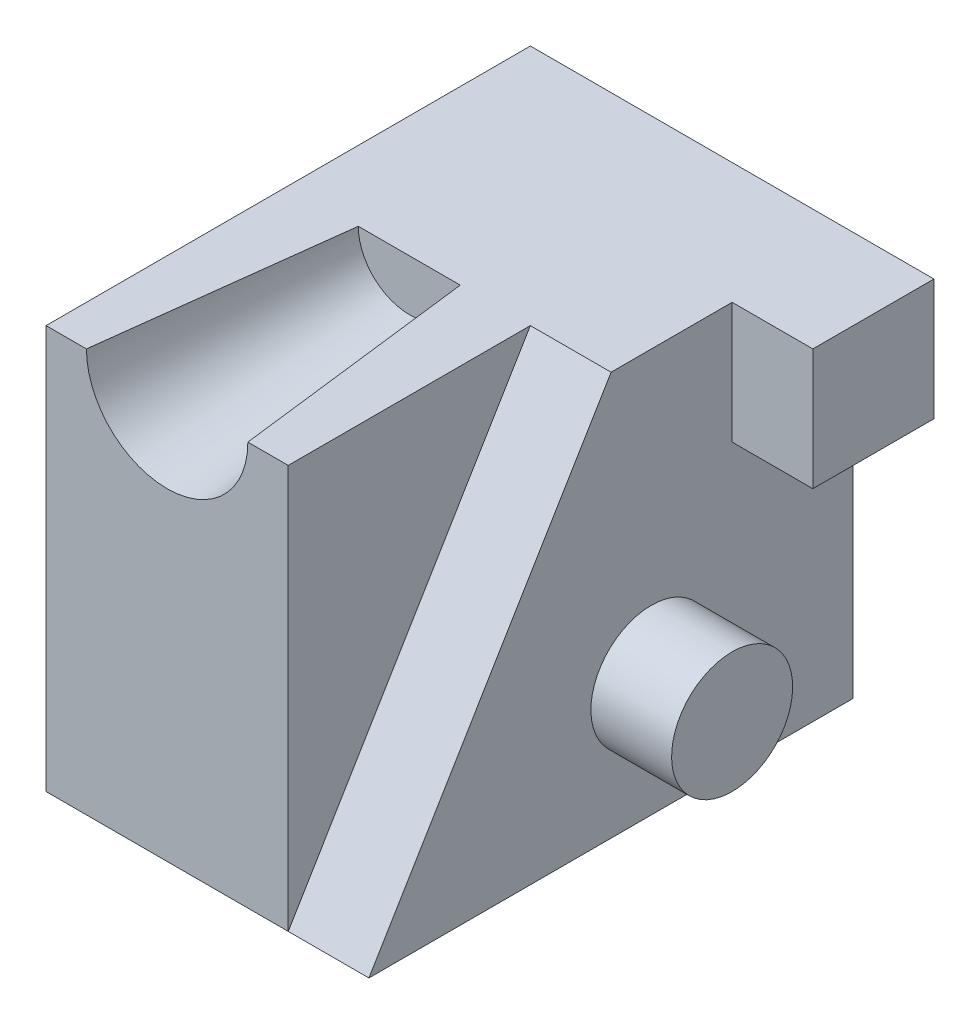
ISO-10303-21;
HEADER;
FILE_DESCRIPTION(('STEP AP214'),'2;1');
FILE_NAME('part.step','',(''),(''),'','','');
FILE_SCHEMA(('AUTOMOTIVE_DESIGN { 1 0 10303 214 1 1 1 1 }'));
ENDSEC;
DATA;
#1=APPLICATION_CONTEXT('core data for automotive mechanical design processes');
#2=APPLICATION_PROTOCOL_DEFINITION('international standard','automotive_design',2000,#1);
#3=PRODUCT_CONTEXT('',#1,'mechanical');
#4=PRODUCT('Part','Part','',(#3));
#5=PRODUCT_RELATED_PRODUCT_CATEGORY('part','',(#4));
#6=PRODUCT_DEFINITION_FORMATION('','',#4);
#7=PRODUCT_DEFINITION_CONTEXT('part definition',#1,'design');
#8=PRODUCT_DEFINITION('design','',#6,#7);
#9=PRODUCT_DEFINITION_SHAPE('','',#8);
#10=(LENGTH_UNIT() NAMED_UNIT(*) SI_UNIT(.MILLI.,.METRE.));
#11=(NAMED_UNIT(*) PLANE_ANGLE_UNIT() SI_UNIT($,.RADIAN.));
#12=(NAMED_UNIT(*) SI_UNIT($,.STERADIAN.) SOLID_ANGLE_UNIT());
#13=UNCERTAINTY_MEASURE_WITH_UNIT(LENGTH_MEASURE(1.E-05),#10,'distance_accuracy_value','');
#14=(GEOMETRIC_REPRESENTATION_CONTEXT(3) GLOBAL_UNCERTAINTY_ASSIGNED_CONTEXT((#13)) GLOBAL_UNIT_ASSIGNED_CONTEXT((#10,
#11,#12)) REPRESENTATION_CONTEXT('',''));
#15=CARTESIAN_POINT('',(0.,0.,0.));
#16=DIRECTION('',(0.,0.,1.));
#17=DIRECTION('',(1.,0.,0.));
#18=AXIS2_PLACEMENT_3D('',#15,#16,#17);
#19=CARTESIAN_POINT('',(0.,0.,30.));
#20=DIRECTION('',(0.,1.,0.));
#21=DIRECTION('',(0.,0.,1.));
#22=AXIS2_PLACEMENT_3D('',#19,#20,#21);
#23=PLANE('',#22);
#24=DIRECTION('',(0.,0.,-1.));
#25=VECTOR('',#24,1.);
#26=CARTESIAN_POINT('',(40.,0.,30.));
#27=LINE('',#26,#25);
#28=CARTESIAN_POINT('',(40.,0.,30.));
#29=VERTEX_POINT('',#28);
#30=CARTESIAN_POINT('',(40.,0.,-30.));
#31=VERTEX_POINT('',#30);
#32=EDGE_CURVE('E212',#29,#31,#27,.T.);
#33=ORIENTED_EDGE('',*,*,#32,.F.);
#34=DIRECTION('',(1.,0.,0.));
#35=VECTOR('',#34,1.);
#36=CARTESIAN_POINT('',(30.,0.,30.));
#37=LINE('',#36,#35);
#38=CARTESIAN_POINT('',(30.,0.,30.));
#39=VERTEX_POINT('',#38);
#40=EDGE_CURVE('E173',#39,#29,#37,.T.);
#41=ORIENTED_EDGE('',*,*,#40,.F.);
#42=DIRECTION('',(1.,0.,0.));
#43=VECTOR('',#42,1.);
#44=CARTESIAN_POINT('',(0.,0.,30.));
#45=LINE('',#44,#43);
#46=CARTESIAN_POINT('',(0.,0.,30.));
#47=VERTEX_POINT('',#46);
#48=EDGE_CURVE('E190',#47,#39,#45,.T.);
#49=ORIENTED_EDGE('',*,*,#48,.F.);
#50=DIRECTION('',(0.,0.,-1.));
#51=VECTOR('',#50,1.);
#52=CARTESIAN_POINT('',(0.,0.,30.));
#53=LINE('',#52,#51);
#54=CARTESIAN_POINT('',(0.,0.,-30.));
#55=VERTEX_POINT('',#54);
#56=EDGE_CURVE('E137',#47,#55,#53,.T.);
#57=ORIENTED_EDGE('',*,*,#56,.T.);
#58=DIRECTION('',(1.,0.,0.));
#59=VECTOR('',#58,1.);
#60=CARTESIAN_POINT('',(0.,0.,-30.));
#61=LINE('',#60,#59);
#62=EDGE_CURVE('E181',#55,#31,#61,.T.);
#63=ORIENTED_EDGE('',*,*,#62,.T.);
#64=EDGE_LOOP('',(#33,#41,#49,#57,#63));
#65=FACE_BOUND('',#64,.T.);
#66=ADVANCED_FACE('F34',(#65),#23,.F.);
#67=CARTESIAN_POINT('',(50.,0.,30.));
#68=DIRECTION('',(-1.,0.,0.));
#69=DIRECTION('',(0.,-1.,0.));
#70=AXIS2_PLACEMENT_3D('',#67,#68,#69);
#71=PLANE('',#70);
#72=DIRECTION('',(0.,0.,-1.));
#73=VECTOR('',#72,1.);
#74=CARTESIAN_POINT('',(50.,35.,-30.));
#75=LINE('',#74,#73);
#76=CARTESIAN_POINT('',(50.,35.,-15.));
#77=VERTEX_POINT('',#76);
#78=CARTESIAN_POINT('',(50.,35.,-30.));
#79=VERTEX_POINT('',#78);
#80=EDGE_CURVE('E124',#77,#79,#75,.T.);
#81=ORIENTED_EDGE('',*,*,#80,.T.);
#82=DIRECTION('',(0.,1.,0.));
#83=VECTOR('',#82,1.);
#84=CARTESIAN_POINT('',(50.,0.,-30.));
#85=LINE('',#84,#83);
#86=CARTESIAN_POINT('',(50.,50.,-30.));
#87=VERTEX_POINT('',#86);
#88=EDGE_CURVE('E135',#79,#87,#85,.T.);
#89=ORIENTED_EDGE('',*,*,#88,.T.);
#90=DIRECTION('',(0.,0.,-1.));
#91=VECTOR('',#90,1.);
#92=CARTESIAN_POINT('',(50.,50.,30.));
#93=LINE('',#92,#91);
#94=CARTESIAN_POINT('',(50.,50.,-15.));
#95=VERTEX_POINT('',#94);
#96=EDGE_CURVE('E128',#95,#87,#93,.T.);
#97=ORIENTED_EDGE('',*,*,#96,.F.);
#98=DIRECTION('',(0.,-1.,0.));
#99=VECTOR('',#98,1.);
#100=CARTESIAN_POINT('',(50.,50.,-15.));
#101=LINE('',#100,#99);
#102=EDGE_CURVE('E114',#95,#77,#101,.T.);
#103=ORIENTED_EDGE('',*,*,#102,.T.);
#104=EDGE_LOOP('',(#81,#89,#97,#103));
#105=FACE_BOUND('',#104,.T.);
#106=ADVANCED_FACE('F133',(#105),#71,.F.);
#107=CARTESIAN_POINT('',(0.,50.,30.));
#108=DIRECTION('',(0.,-1.,0.));
#109=DIRECTION('',(0.,0.,-1.));
#110=AXIS2_PLACEMENT_3D('',#107,#108,#109);
#111=PLANE('',#110);
#112=DIRECTION('',(-1.,0.,0.));
#113=VECTOR('',#112,1.);
#114=CARTESIAN_POINT('',(0.,50.,-30.));
#115=LINE('',#114,#113);
#116=CARTESIAN_POINT('',(0.,50.,-30.));
#117=VERTEX_POINT('',#116);
#118=EDGE_CURVE('E185',#87,#117,#115,.T.);
#119=ORIENTED_EDGE('',*,*,#118,.T.);
#120=DIRECTION('',(0.,0.,-1.));
#121=VECTOR('',#120,1.);
#122=CARTESIAN_POINT('',(0.,50.,30.));
#123=LINE('',#122,#121);
#124=CARTESIAN_POINT('',(0.,50.,30.));
#125=VERTEX_POINT('',#124);
#126=EDGE_CURVE('E138',#125,#117,#123,.T.);
#127=ORIENTED_EDGE('',*,*,#126,.F.);
#128=DIRECTION('',(-1.,0.,0.));
#129=VECTOR('',#128,1.);
#130=CARTESIAN_POINT('',(0.,50.,30.));
#131=LINE('',#130,#129);
#132=CARTESIAN_POINT('',(5.,50.,30.));
#133=VERTEX_POINT('',#132);
#134=EDGE_CURVE('E160',#133,#125,#131,.T.);
#135=ORIENTED_EDGE('',*,*,#134,.F.);
#136=DIRECTION('',(0.121869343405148,0.,-0.992546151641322));
#137=VECTOR('',#136,1.);
#138=CARTESIAN_POINT('',(15.,50.,-51.4434642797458));
#139=LINE('',#138,#137);
#140=CARTESIAN_POINT('',(8.68353682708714,50.,0.));
#141=VERTEX_POINT('',#140);
#142=EDGE_CURVE('E56',#133,#141,#139,.T.);
#143=ORIENTED_EDGE('',*,*,#142,.T.);
#144=DIRECTION('',(-1.,0.,0.));
#145=VECTOR('',#144,1.);
#146=CARTESIAN_POINT('',(0.,50.,0.));
#147=LINE('',#146,#145);
#148=CARTESIAN_POINT('',(21.3164631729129,50.,0.));
#149=VERTEX_POINT('',#148);
#150=EDGE_CURVE('E42',#149,#141,#147,.T.);
#151=ORIENTED_EDGE('',*,*,#150,.F.);
#152=DIRECTION('',(0.121869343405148,0.,0.992546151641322));
#153=VECTOR('',#152,1.);
#154=CARTESIAN_POINT('',(15.,50.,-51.4434642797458));
#155=LINE('',#154,#153);
#156=CARTESIAN_POINT('',(25.,50.,30.));
#157=VERTEX_POINT('',#156);
#158=EDGE_CURVE('E155',#149,#157,#155,.T.);
#159=ORIENTED_EDGE('',*,*,#158,.T.);
#160=CARTESIAN_POINT('',(30.,50.,30.));
#161=VERTEX_POINT('',#160);
#162=EDGE_CURVE('E144',#161,#157,#131,.T.);
#163=ORIENTED_EDGE('',*,*,#162,.F.);
#164=DIRECTION('',(0.,0.,1.));
#165=VECTOR('',#164,1.);
#166=CARTESIAN_POINT('',(30.,50.,30.));
#167=LINE('',#166,#165);
#168=CARTESIAN_POINT('',(30.,50.,0.));
#169=VERTEX_POINT('',#168);
#170=EDGE_CURVE('E171',#169,#161,#167,.T.);
#171=ORIENTED_EDGE('',*,*,#170,.F.);
#172=DIRECTION('',(1.,0.,0.));
#173=VECTOR('',#172,1.);
#174=CARTESIAN_POINT('',(30.,50.,0.));
#175=LINE('',#174,#173);
#176=CARTESIAN_POINT('',(40.,50.,0.));
#177=VERTEX_POINT('',#176);
#178=EDGE_CURVE('E174',#169,#177,#175,.T.);
#179=ORIENTED_EDGE('',*,*,#178,.T.);
#180=DIRECTION('',(0.,0.,1.));
#181=VECTOR('',#180,1.);
#182=CARTESIAN_POINT('',(40.,50.,30.));
#183=LINE('',#182,#181);
#184=CARTESIAN_POINT('',(40.,50.,-15.));
#185=VERTEX_POINT('',#184);
#186=EDGE_CURVE('E48',#185,#177,#183,.T.);
#187=ORIENTED_EDGE('',*,*,#186,.F.);
#188=DIRECTION('',(1.,0.,0.));
#189=VECTOR('',#188,1.);
#190=CARTESIAN_POINT('',(40.,50.,-15.));
#191=LINE('',#190,#189);
#192=EDGE_CURVE('E118',#185,#95,#191,.T.);
#193=ORIENTED_EDGE('',*,*,#192,.T.);
#194=ORIENTED_EDGE('',*,*,#96,.T.);
#195=EDGE_LOOP('',(#119,#127,#135,#143,#151,#159,#163,#171,#179,#187,#193,#194));
#196=FACE_BOUND('',#195,.T.);
#197=ADVANCED_FACE('F127',(#196),#111,.F.);
#198=CARTESIAN_POINT('',(0.,50.,-30.));
#199=DIRECTION('',(0.,0.,-1.));
#200=DIRECTION('',(-1.,0.,0.));
#201=AXIS2_PLACEMENT_3D('',#198,#199,#200);
#202=PLANE('',#201);
#203=DIRECTION('',(1.,0.,0.));
#204=VECTOR('',#203,1.);
#205=CARTESIAN_POINT('',(40.,35.,-30.));
#206=LINE('',#205,#204);
#207=CARTESIAN_POINT('',(40.,35.,-30.));
#208=VERTEX_POINT('',#207);
#209=EDGE_CURVE('E222',#208,#79,#206,.T.);
#210=ORIENTED_EDGE('',*,*,#209,.F.);
#211=DIRECTION('',(0.,-1.,0.));
#212=VECTOR('',#211,1.);
#213=CARTESIAN_POINT('',(40.,50.,-30.));
#214=LINE('',#213,#212);
#215=EDGE_CURVE('E156',#208,#31,#214,.T.);
#216=ORIENTED_EDGE('',*,*,#215,.T.);
#217=ORIENTED_EDGE('',*,*,#62,.F.);
#218=DIRECTION('',(0.,-1.,0.));
#219=VECTOR('',#218,1.);
#220=CARTESIAN_POINT('',(0.,0.,-30.));
#221=LINE('',#220,#219);
#222=EDGE_CURVE('E176',#117,#55,#221,.T.);
#223=ORIENTED_EDGE('',*,*,#222,.F.);
#224=ORIENTED_EDGE('',*,*,#118,.F.);
#225=ORIENTED_EDGE('',*,*,#88,.F.);
#226=EDGE_LOOP('',(#210,#216,#217,#223,#224,#225));
#227=FACE_BOUND('',#226,.T.);
#228=ADVANCED_FACE('F233',(#227),#202,.T.);
#229=CARTESIAN_POINT('',(30.,50.,0.));
#230=DIRECTION('',(0.,-0.514495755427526,-0.857492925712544));
#231=DIRECTION('',(0.,0.857492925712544,-0.514495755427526));
#232=AXIS2_PLACEMENT_3D('',#229,#230,#231);
#233=PLANE('',#232);
#234=DIRECTION('',(0.,-0.857492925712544,0.514495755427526));
#235=VECTOR('',#234,1.);
#236=CARTESIAN_POINT('',(40.,50.,0.));
#237=LINE('',#236,#235);
#238=EDGE_CURVE('E12',#177,#29,#237,.T.);
#239=ORIENTED_EDGE('',*,*,#238,.F.);
#240=ORIENTED_EDGE('',*,*,#178,.F.);
#241=DIRECTION('',(0.,0.857492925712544,-0.514495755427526));
#242=VECTOR('',#241,1.);
#243=CARTESIAN_POINT('',(30.,50.,0.));
#244=LINE('',#243,#242);
#245=EDGE_CURVE('E168',#39,#169,#244,.T.);
#246=ORIENTED_EDGE('',*,*,#245,.F.);
#247=ORIENTED_EDGE('',*,*,#40,.T.);
#248=EDGE_LOOP('',(#239,#240,#246,#247));
#249=FACE_BOUND('',#248,.T.);
#250=ADVANCED_FACE('F208',(#249),#233,.F.);
#251=CARTESIAN_POINT('',(0.,0.,30.));
#252=DIRECTION('',(1.,0.,0.));
#253=DIRECTION('',(0.,0.,-1.));
#254=AXIS2_PLACEMENT_3D('',#251,#252,#253);
#255=PLANE('',#254);
#256=ORIENTED_EDGE('',*,*,#222,.T.);
#257=ORIENTED_EDGE('',*,*,#56,.F.);
#258=DIRECTION('',(0.,-1.,0.));
#259=VECTOR('',#258,1.);
#260=CARTESIAN_POINT('',(0.,0.,30.));
#261=LINE('',#260,#259);
#262=EDGE_CURVE('E187',#125,#47,#261,.T.);
#263=ORIENTED_EDGE('',*,*,#262,.F.);
#264=ORIENTED_EDGE('',*,*,#126,.T.);
#265=EDGE_LOOP('',(#256,#257,#263,#264));
#266=FACE_BOUND('',#265,.T.);
#267=ADVANCED_FACE('F36',(#266),#255,.F.);
#268=CARTESIAN_POINT('',(0.,50.,30.));
#269=DIRECTION('',(0.,0.,-1.));
#270=DIRECTION('',(-1.,0.,0.));
#271=AXIS2_PLACEMENT_3D('',#268,#269,#270);
#272=PLANE('',#271);
#273=ORIENTED_EDGE('',*,*,#162,.T.);
#274=CARTESIAN_POINT('',(15.,50.,30.));
#275=DIRECTION('',(0.,0.,-1.));
#276=DIRECTION('',(-1.,0.,0.));
#277=AXIS2_PLACEMENT_3D('',#274,#275,#276);
#278=CIRCLE('',#277,10.);
#279=EDGE_CURVE('E141',#157,#133,#278,.T.);
#280=ORIENTED_EDGE('',*,*,#279,.T.);
#281=ORIENTED_EDGE('',*,*,#134,.T.);
#282=ORIENTED_EDGE('',*,*,#262,.T.);
#283=ORIENTED_EDGE('',*,*,#48,.T.);
#284=DIRECTION('',(0.,-1.,0.));
#285=VECTOR('',#284,1.);
#286=CARTESIAN_POINT('',(30.,0.,30.));
#287=LINE('',#286,#285);
#288=EDGE_CURVE('E162',#161,#39,#287,.T.);
#289=ORIENTED_EDGE('',*,*,#288,.F.);
#290=EDGE_LOOP('',(#273,#280,#281,#282,#283,#289));
#291=FACE_BOUND('',#290,.T.);
#292=ADVANCED_FACE('F196',(#291),#272,.F.);
#293=CARTESIAN_POINT('',(30.,50.,30.));
#294=DIRECTION('',(-1.,0.,0.));
#295=DIRECTION('',(0.,-1.,0.));
#296=AXIS2_PLACEMENT_3D('',#293,#294,#295);
#297=PLANE('',#296);
#298=ORIENTED_EDGE('',*,*,#288,.T.);
#299=ORIENTED_EDGE('',*,*,#245,.T.);
#300=ORIENTED_EDGE('',*,*,#170,.T.);
#301=EDGE_LOOP('',(#298,#299,#300));
#302=FACE_BOUND('',#301,.T.);
#303=ADVANCED_FACE('F206',(#302),#297,.F.);
#304=CARTESIAN_POINT('',(15.,50.,0.));
#305=DIRECTION('',(0.,0.,1.));
#306=DIRECTION('',(1.,0.,0.));
#307=AXIS2_PLACEMENT_3D('',#304,#305,#306);
#308=PLANE('',#307);
#309=ORIENTED_EDGE('',*,*,#150,.T.);
#310=CARTESIAN_POINT('',(15.,50.,0.));
#311=DIRECTION('',(0.,0.,1.));
#312=DIRECTION('',(1.,0.,0.));
#313=AXIS2_PLACEMENT_3D('',#310,#311,#312);
#314=CIRCLE('',#313,6.31646317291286);
#315=EDGE_CURVE('E152',#141,#149,#314,.T.);
#316=ORIENTED_EDGE('',*,*,#315,.T.);
#317=EDGE_LOOP('',(#309,#316));
#318=FACE_BOUND('',#317,.T.);
#319=ADVANCED_FACE('F151',(#318),#308,.T.);
#320=CARTESIAN_POINT('',(15.,50.,30.));
#321=DIRECTION('',(0.,0.,1.));
#322=DIRECTION('',(1.,0.,0.));
#323=AXIS2_PLACEMENT_3D('',#320,#321,#322);
#324=CONICAL_SURFACE('',#323,10.,0.122173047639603);
#325=ORIENTED_EDGE('',*,*,#315,.F.);
#326=ORIENTED_EDGE('',*,*,#142,.F.);
#327=ORIENTED_EDGE('',*,*,#279,.F.);
#328=ORIENTED_EDGE('',*,*,#158,.F.);
#329=EDGE_LOOP('',(#325,#326,#327,#328));
#330=FACE_BOUND('',#329,.T.);
#331=ADVANCED_FACE('F154',(#330),#324,.F.);
#332=CARTESIAN_POINT('',(40.,25.,0.));
#333=DIRECTION('',(1.,0.,0.));
#334=DIRECTION('',(0.,1.,0.));
#335=AXIS2_PLACEMENT_3D('',#332,#333,#334);
#336=PLANE('',#335);
#337=DIRECTION('',(0.,0.,-1.));
#338=VECTOR('',#337,1.);
#339=CARTESIAN_POINT('',(40.,35.,-30.));
#340=LINE('',#339,#338);
#341=CARTESIAN_POINT('',(40.,35.,-15.));
#342=VERTEX_POINT('',#341);
#343=EDGE_CURVE('E131',#342,#208,#340,.T.);
#344=ORIENTED_EDGE('',*,*,#343,.F.);
#345=DIRECTION('',(0.,-1.,0.));
#346=VECTOR('',#345,1.);
#347=CARTESIAN_POINT('',(40.,50.,-15.));
#348=LINE('',#347,#346);
#349=EDGE_CURVE('E228',#185,#342,#348,.T.);
#350=ORIENTED_EDGE('',*,*,#349,.F.);
#351=ORIENTED_EDGE('',*,*,#186,.T.);
#352=ORIENTED_EDGE('',*,*,#238,.T.);
#353=ORIENTED_EDGE('',*,*,#32,.T.);
#354=ORIENTED_EDGE('',*,*,#215,.F.);
#355=EDGE_LOOP('',(#344,#350,#351,#352,#353,#354));
#356=FACE_BOUND('',#355,.T.);
#357=CARTESIAN_POINT('',(40.,15.,-5.));
#358=DIRECTION('',(1.,0.,0.));
#359=DIRECTION('',(0.,1.,0.));
#360=AXIS2_PLACEMENT_3D('',#357,#358,#359);
#361=CIRCLE('',#360,7.5);
#362=CARTESIAN_POINT('',(40.,22.5,-5.));
#363=VERTEX_POINT('',#362);
#364=EDGE_CURVE('E215',#363,#363,#361,.T.);
#365=ORIENTED_EDGE('',*,*,#364,.F.);
#366=EDGE_LOOP('',(#365));
#367=FACE_BOUND('',#366,.T.);
#368=ADVANCED_FACE('F210',(#356,#367),#336,.T.);
#369=CARTESIAN_POINT('',(40.,15.,-5.));
#370=DIRECTION('',(1.,0.,0.));
#371=DIRECTION('',(0.,1.,0.));
#372=AXIS2_PLACEMENT_3D('',#369,#370,#371);
#373=CYLINDRICAL_SURFACE('',#372,7.5);
#374=ORIENTED_EDGE('',*,*,#364,.T.);
#375=EDGE_LOOP('',(#374));
#376=FACE_BOUND('',#375,.T.);
#377=CARTESIAN_POINT('',(50.,15.,-5.));
#378=DIRECTION('',(1.,0.,0.));
#379=DIRECTION('',(0.,1.,0.));
#380=AXIS2_PLACEMENT_3D('',#377,#378,#379);
#381=CIRCLE('',#380,7.5);
#382=CARTESIAN_POINT('',(50.,22.5,-5.));
#383=VERTEX_POINT('',#382);
#384=EDGE_CURVE('E220',#383,#383,#381,.T.);
#385=ORIENTED_EDGE('',*,*,#384,.F.);
#386=EDGE_LOOP('',(#385));
#387=FACE_BOUND('',#386,.T.);
#388=ADVANCED_FACE('F236',(#376,#387),#373,.T.);
#389=CARTESIAN_POINT('',(40.,35.,-30.));
#390=DIRECTION('',(0.,-1.,0.));
#391=DIRECTION('',(1.,0.,0.));
#392=AXIS2_PLACEMENT_3D('',#389,#390,#391);
#393=PLANE('',#392);
#394=ORIENTED_EDGE('',*,*,#80,.F.);
#395=DIRECTION('',(1.,0.,0.));
#396=VECTOR('',#395,1.);
#397=CARTESIAN_POINT('',(40.,35.,-15.));
#398=LINE('',#397,#396);
#399=EDGE_CURVE('E119',#342,#77,#398,.T.);
#400=ORIENTED_EDGE('',*,*,#399,.F.);
#401=ORIENTED_EDGE('',*,*,#343,.T.);
#402=ORIENTED_EDGE('',*,*,#209,.T.);
#403=EDGE_LOOP('',(#394,#400,#401,#402));
#404=FACE_BOUND('',#403,.T.);
#405=ADVANCED_FACE('F234',(#404),#393,.T.);
#406=CARTESIAN_POINT('',(40.,50.,-15.));
#407=DIRECTION('',(0.,0.,1.));
#408=DIRECTION('',(0.,-1.,0.));
#409=AXIS2_PLACEMENT_3D('',#406,#407,#408);
#410=PLANE('',#409);
#411=ORIENTED_EDGE('',*,*,#102,.F.);
#412=ORIENTED_EDGE('',*,*,#192,.F.);
#413=ORIENTED_EDGE('',*,*,#349,.T.);
#414=ORIENTED_EDGE('',*,*,#399,.T.);
#415=EDGE_LOOP('',(#411,#412,#413,#414));
#416=FACE_BOUND('',#415,.T.);
#417=ADVANCED_FACE('F116',(#416),#410,.T.);
#418=ORIENTED_EDGE('',*,*,#384,.T.);
#419=EDGE_LOOP('',(#418));
#420=FACE_BOUND('',#419,.T.);
#421=ADVANCED_FACE('F242',(#420),#71,.F.);
#422=CLOSED_SHELL('',(#66,#106,#197,#228,#250,#267,#292,#303,#319,#331,#368,#388,#405,#417,#421));
#423=MANIFOLD_SOLID_BREP('B2',#422);
#424=ADVANCED_BREP_SHAPE_REPRESENTATION('',(#18,#423),#14);
#425=SHAPE_DEFINITION_REPRESENTATION(#9,#424);
ENDSEC;
END-ISO-10303-21;
